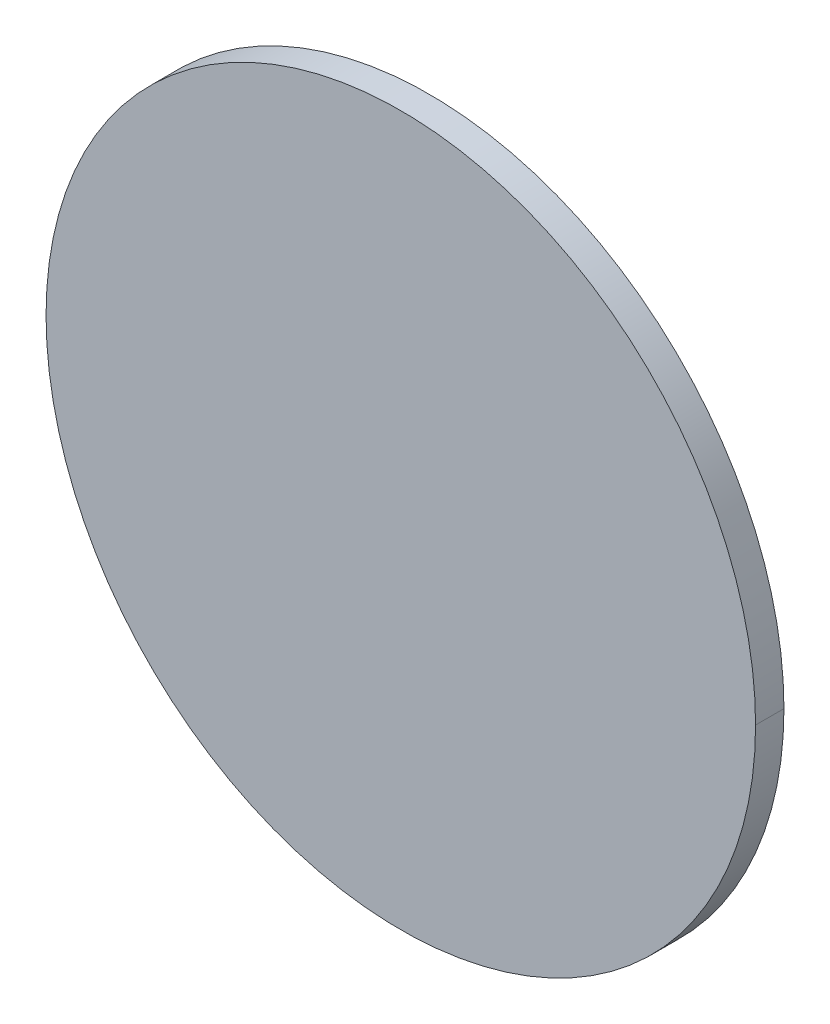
ISO-10303-21;
HEADER;
FILE_DESCRIPTION(('STEP AP214'),'2;1');
FILE_NAME('part.step','',(''),(''),'','','');
FILE_SCHEMA(('AUTOMOTIVE_DESIGN { 1 0 10303 214 1 1 1 1 }'));
ENDSEC;
DATA;
#1=APPLICATION_CONTEXT('core data for automotive mechanical design processes');
#2=APPLICATION_PROTOCOL_DEFINITION('international standard','automotive_design',2000,#1);
#3=PRODUCT_CONTEXT('',#1,'mechanical');
#4=PRODUCT('Part','Part','',(#3));
#5=PRODUCT_RELATED_PRODUCT_CATEGORY('part','',(#4));
#6=PRODUCT_DEFINITION_FORMATION('','',#4);
#7=PRODUCT_DEFINITION_CONTEXT('part definition',#1,'design');
#8=PRODUCT_DEFINITION('design','',#6,#7);
#9=PRODUCT_DEFINITION_SHAPE('','',#8);
#10=(LENGTH_UNIT() NAMED_UNIT(*) SI_UNIT(.MILLI.,.METRE.));
#11=(NAMED_UNIT(*) PLANE_ANGLE_UNIT() SI_UNIT($,.RADIAN.));
#12=(NAMED_UNIT(*) SI_UNIT($,.STERADIAN.) SOLID_ANGLE_UNIT());
#13=UNCERTAINTY_MEASURE_WITH_UNIT(LENGTH_MEASURE(1.E-05),#10,'distance_accuracy_value','');
#14=(GEOMETRIC_REPRESENTATION_CONTEXT(3) GLOBAL_UNCERTAINTY_ASSIGNED_CONTEXT((#13)) GLOBAL_UNIT_ASSIGNED_CONTEXT((#10,
#11,#12)) REPRESENTATION_CONTEXT('',''));
#15=CARTESIAN_POINT('',(0.,0.,0.));
#16=DIRECTION('',(0.,0.,1.));
#17=DIRECTION('',(1.,0.,0.));
#18=AXIS2_PLACEMENT_3D('',#15,#16,#17);
#19=CARTESIAN_POINT('',(0.,0.,0.));
#20=DIRECTION('',(0.,0.,1.));
#21=DIRECTION('',(1.,0.,0.));
#22=AXIS2_PLACEMENT_3D('',#19,#20,#21);
#23=PLANE('',#22);
#24=CARTESIAN_POINT('',(0.,0.,0.));
#25=DIRECTION('',(0.,0.,1.));
#26=DIRECTION('',(1.,0.,0.));
#27=AXIS2_PLACEMENT_3D('',#24,#25,#26);
#28=CIRCLE('',#27,25.);
#29=CARTESIAN_POINT('',(-25.,0.,0.));
#30=VERTEX_POINT('',#29);
#31=CARTESIAN_POINT('',(25.,0.,0.));
#32=VERTEX_POINT('',#31);
#33=EDGE_CURVE('E11',#30,#32,#28,.T.);
#34=ORIENTED_EDGE('',*,*,#33,.F.);
#35=CARTESIAN_POINT('',(0.,0.,0.));
#36=DIRECTION('',(0.,0.,1.));
#37=DIRECTION('',(1.,0.,0.));
#38=AXIS2_PLACEMENT_3D('',#35,#36,#37);
#39=CIRCLE('',#38,25.);
#40=EDGE_CURVE('E66',#32,#30,#39,.T.);
#41=ORIENTED_EDGE('',*,*,#40,.F.);
#42=EDGE_LOOP('',(#34,#41));
#43=FACE_BOUND('',#42,.T.);
#44=ADVANCED_FACE('F16',(#43),#23,.F.);
#45=CARTESIAN_POINT('',(0.,0.,2.));
#46=DIRECTION('',(0.,0.,1.));
#47=DIRECTION('',(1.,0.,0.));
#48=AXIS2_PLACEMENT_3D('',#45,#46,#47);
#49=PLANE('',#48);
#50=CARTESIAN_POINT('',(0.,0.,2.));
#51=DIRECTION('',(0.,0.,1.));
#52=DIRECTION('',(1.,0.,0.));
#53=AXIS2_PLACEMENT_3D('',#50,#51,#52);
#54=CIRCLE('',#53,25.);
#55=CARTESIAN_POINT('',(-25.,0.,2.));
#56=VERTEX_POINT('',#55);
#57=CARTESIAN_POINT('',(25.,0.,2.));
#58=VERTEX_POINT('',#57);
#59=EDGE_CURVE('E20',#56,#58,#54,.T.);
#60=ORIENTED_EDGE('',*,*,#59,.T.);
#61=CARTESIAN_POINT('',(0.,0.,2.));
#62=DIRECTION('',(0.,0.,1.));
#63=DIRECTION('',(1.,0.,0.));
#64=AXIS2_PLACEMENT_3D('',#61,#62,#63);
#65=CIRCLE('',#64,25.);
#66=EDGE_CURVE('E57',#58,#56,#65,.T.);
#67=ORIENTED_EDGE('',*,*,#66,.T.);
#68=EDGE_LOOP('',(#60,#67));
#69=FACE_BOUND('',#68,.T.);
#70=ADVANCED_FACE('F55',(#69),#49,.T.);
#71=CARTESIAN_POINT('',(0.,0.,2.));
#72=DIRECTION('',(0.,0.,-1.));
#73=DIRECTION('',(-1.,0.,0.));
#74=AXIS2_PLACEMENT_3D('',#71,#72,#73);
#75=CYLINDRICAL_SURFACE('',#74,25.);
#76=DIRECTION('',(0.,0.,-1.));
#77=VECTOR('',#76,1.);
#78=CARTESIAN_POINT('',(25.,0.,2.));
#79=LINE('',#78,#77);
#80=EDGE_CURVE('E61',#58,#32,#79,.T.);
#81=ORIENTED_EDGE('',*,*,#80,.F.);
#82=ORIENTED_EDGE('',*,*,#59,.F.);
#83=DIRECTION('',(0.,0.,-1.));
#84=VECTOR('',#83,1.);
#85=CARTESIAN_POINT('',(-25.,0.,2.));
#86=LINE('',#85,#84);
#87=EDGE_CURVE('E59',#56,#30,#86,.T.);
#88=ORIENTED_EDGE('',*,*,#87,.T.);
#89=ORIENTED_EDGE('',*,*,#33,.T.);
#90=EDGE_LOOP('',(#81,#82,#88,#89));
#91=FACE_BOUND('',#90,.T.);
#92=ADVANCED_FACE('F62',(#91),#75,.T.);
#93=CARTESIAN_POINT('',(0.,0.,2.));
#94=DIRECTION('',(0.,0.,-1.));
#95=DIRECTION('',(-1.,0.,0.));
#96=AXIS2_PLACEMENT_3D('',#93,#94,#95);
#97=CYLINDRICAL_SURFACE('',#96,25.);
#98=ORIENTED_EDGE('',*,*,#66,.F.);
#99=ORIENTED_EDGE('',*,*,#80,.T.);
#100=ORIENTED_EDGE('',*,*,#40,.T.);
#101=ORIENTED_EDGE('',*,*,#87,.F.);
#102=EDGE_LOOP('',(#98,#99,#100,#101));
#103=FACE_BOUND('',#102,.T.);
#104=ADVANCED_FACE('F18',(#103),#97,.T.);
#105=CLOSED_SHELL('',(#44,#70,#92,#104));
#106=MANIFOLD_SOLID_BREP('B1',#105);
#107=ADVANCED_BREP_SHAPE_REPRESENTATION('',(#18,#106),#14);
#108=SHAPE_DEFINITION_REPRESENTATION(#9,#107);
ENDSEC;
END-ISO-10303-21;
